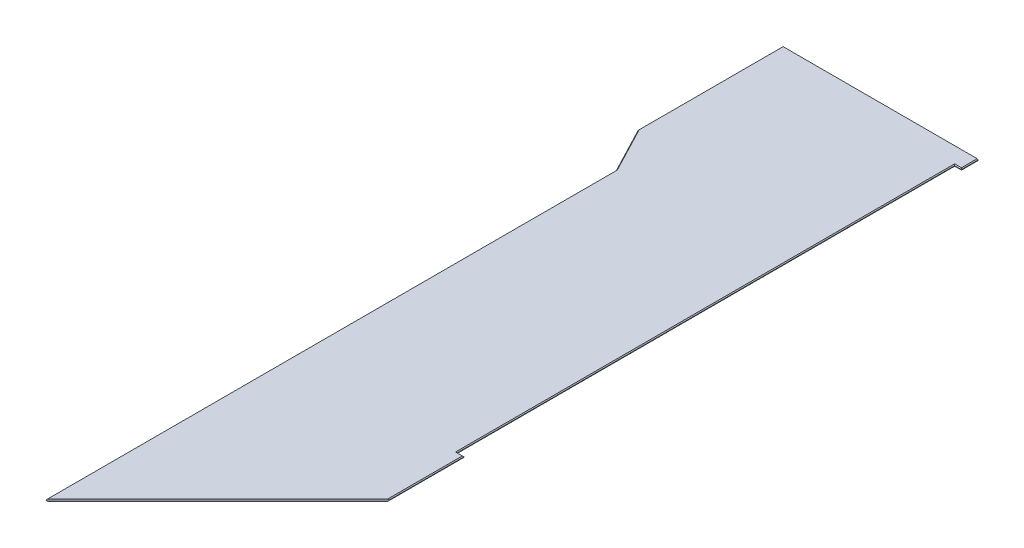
ISO-10303-21;
HEADER;
FILE_DESCRIPTION(('STEP AP214'),'2;1');
FILE_NAME('part.step','',(''),(''),'','','');
FILE_SCHEMA(('AUTOMOTIVE_DESIGN { 1 0 10303 214 1 1 1 1 }'));
ENDSEC;
DATA;
#1=APPLICATION_CONTEXT('core data for automotive mechanical design processes');
#2=APPLICATION_PROTOCOL_DEFINITION('international standard','automotive_design',2000,#1);
#3=PRODUCT_CONTEXT('',#1,'mechanical');
#4=PRODUCT('Part','Part','',(#3));
#5=PRODUCT_RELATED_PRODUCT_CATEGORY('part','',(#4));
#6=PRODUCT_DEFINITION_FORMATION('','',#4);
#7=PRODUCT_DEFINITION_CONTEXT('part definition',#1,'design');
#8=PRODUCT_DEFINITION('design','',#6,#7);
#9=PRODUCT_DEFINITION_SHAPE('','',#8);
#10=(LENGTH_UNIT() NAMED_UNIT(*) SI_UNIT(.MILLI.,.METRE.));
#11=(NAMED_UNIT(*) PLANE_ANGLE_UNIT() SI_UNIT($,.RADIAN.));
#12=(NAMED_UNIT(*) SI_UNIT($,.STERADIAN.) SOLID_ANGLE_UNIT());
#13=UNCERTAINTY_MEASURE_WITH_UNIT(LENGTH_MEASURE(1.E-05),#10,'distance_accuracy_value','');
#14=(GEOMETRIC_REPRESENTATION_CONTEXT(3) GLOBAL_UNCERTAINTY_ASSIGNED_CONTEXT((#13)) GLOBAL_UNIT_ASSIGNED_CONTEXT((#10,
#11,#12)) REPRESENTATION_CONTEXT('',''));
#15=CARTESIAN_POINT('',(0.,0.,0.));
#16=DIRECTION('',(0.,0.,1.));
#17=DIRECTION('',(1.,0.,0.));
#18=AXIS2_PLACEMENT_3D('',#15,#16,#17);
#19=CARTESIAN_POINT('',(552.551731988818,6.35,994.453846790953));
#20=DIRECTION('',(0.,0.,1.));
#21=DIRECTION('',(1.,0.,0.));
#22=AXIS2_PLACEMENT_3D('',#19,#20,#21);
#23=PLANE('',#22);
#24=DIRECTION('',(0.,-1.,0.));
#25=VECTOR('',#24,1.);
#26=CARTESIAN_POINT('',(552.551731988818,6.35,994.453846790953));
#27=LINE('',#26,#25);
#28=CARTESIAN_POINT('',(552.551731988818,1.35000000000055,994.453846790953));
#29=VERTEX_POINT('',#28);
#30=CARTESIAN_POINT('',(552.551731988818,-1.35000000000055,994.453846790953));
#31=VERTEX_POINT('',#30);
#32=EDGE_CURVE('E394',#29,#31,#27,.T.);
#33=ORIENTED_EDGE('',*,*,#32,.T.);
#34=DIRECTION('',(-1.,0.,0.));
#35=VECTOR('',#34,1.);
#36=CARTESIAN_POINT('',(511.451731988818,-1.35000000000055,994.453846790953));
#37=LINE('',#36,#35);
#38=CARTESIAN_POINT('',(511.451731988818,-1.35000000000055,994.453846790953));
#39=VERTEX_POINT('',#38);
#40=EDGE_CURVE('E326',#31,#39,#37,.T.);
#41=ORIENTED_EDGE('',*,*,#40,.T.);
#42=DIRECTION('',(0.,-1.,0.));
#43=VECTOR('',#42,1.);
#44=CARTESIAN_POINT('',(511.451731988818,6.35,994.453846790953));
#45=LINE('',#44,#43);
#46=CARTESIAN_POINT('',(511.451731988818,1.35000000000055,994.453846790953));
#47=VERTEX_POINT('',#46);
#48=EDGE_CURVE('E220',#47,#39,#45,.T.);
#49=ORIENTED_EDGE('',*,*,#48,.F.);
#50=DIRECTION('',(1.,0.,0.));
#51=VECTOR('',#50,1.);
#52=CARTESIAN_POINT('',(552.551731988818,1.35000000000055,994.453846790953));
#53=LINE('',#52,#51);
#54=EDGE_CURVE('E72',#47,#29,#53,.T.);
#55=ORIENTED_EDGE('',*,*,#54,.T.);
#56=EDGE_LOOP('',(#33,#41,#49,#55));
#57=FACE_BOUND('',#56,.T.);
#58=ADVANCED_FACE('F50',(#57),#23,.F.);
#59=CARTESIAN_POINT('',(511.451731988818,6.35,994.453846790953));
#60=DIRECTION('',(-1.,0.,0.));
#61=DIRECTION('',(0.,0.,1.));
#62=AXIS2_PLACEMENT_3D('',#59,#60,#61);
#63=PLANE('',#62);
#64=ORIENTED_EDGE('',*,*,#48,.T.);
#65=DIRECTION('',(0.,0.,-1.));
#66=VECTOR('',#65,1.);
#67=CARTESIAN_POINT('',(511.451731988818,-1.35000000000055,-2017.54615320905));
#68=LINE('',#67,#66);
#69=CARTESIAN_POINT('',(511.451731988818,-1.35000000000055,-2017.54615320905));
#70=VERTEX_POINT('',#69);
#71=EDGE_CURVE('E323',#39,#70,#68,.T.);
#72=ORIENTED_EDGE('',*,*,#71,.T.);
#73=DIRECTION('',(0.,-1.,0.));
#74=VECTOR('',#73,1.);
#75=CARTESIAN_POINT('',(511.451731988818,6.35,-2017.54615320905));
#76=LINE('',#75,#74);
#77=CARTESIAN_POINT('',(511.451731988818,1.35000000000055,-2017.54615320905));
#78=VERTEX_POINT('',#77);
#79=EDGE_CURVE('E228',#78,#70,#76,.T.);
#80=ORIENTED_EDGE('',*,*,#79,.F.);
#81=DIRECTION('',(0.,0.,1.));
#82=VECTOR('',#81,1.);
#83=CARTESIAN_POINT('',(511.451731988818,1.35000000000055,994.453846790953));
#84=LINE('',#83,#82);
#85=EDGE_CURVE('E325',#78,#47,#84,.T.);
#86=ORIENTED_EDGE('',*,*,#85,.T.);
#87=EDGE_LOOP('',(#64,#72,#80,#86));
#88=FACE_BOUND('',#87,.T.);
#89=ADVANCED_FACE('F464',(#88),#63,.F.);
#90=CARTESIAN_POINT('',(511.451731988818,6.35,-2017.54615320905));
#91=DIRECTION('',(0.,0.,-1.));
#92=DIRECTION('',(-1.,0.,0.));
#93=AXIS2_PLACEMENT_3D('',#90,#91,#92);
#94=PLANE('',#93);
#95=ORIENTED_EDGE('',*,*,#79,.T.);
#96=DIRECTION('',(1.,0.,0.));
#97=VECTOR('',#96,1.);
#98=CARTESIAN_POINT('',(552.551731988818,-1.35000000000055,-2017.54615320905));
#99=LINE('',#98,#97);
#100=CARTESIAN_POINT('',(552.551731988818,-1.35000000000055,-2017.54615320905));
#101=VERTEX_POINT('',#100);
#102=EDGE_CURVE('E316',#70,#101,#99,.T.);
#103=ORIENTED_EDGE('',*,*,#102,.T.);
#104=DIRECTION('',(0.,-1.,0.));
#105=VECTOR('',#104,1.);
#106=CARTESIAN_POINT('',(552.551731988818,6.35,-2017.54615320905));
#107=LINE('',#106,#105);
#108=CARTESIAN_POINT('',(552.551731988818,1.35000000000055,-2017.54615320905));
#109=VERTEX_POINT('',#108);
#110=EDGE_CURVE('E411',#109,#101,#107,.T.);
#111=ORIENTED_EDGE('',*,*,#110,.F.);
#112=DIRECTION('',(-1.,0.,0.));
#113=VECTOR('',#112,1.);
#114=CARTESIAN_POINT('',(511.451731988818,1.35000000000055,-2017.54615320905));
#115=LINE('',#114,#113);
#116=EDGE_CURVE('E317',#109,#78,#115,.T.);
#117=ORIENTED_EDGE('',*,*,#116,.T.);
#118=EDGE_LOOP('',(#95,#103,#111,#117));
#119=FACE_BOUND('',#118,.T.);
#120=ADVANCED_FACE('F421',(#119),#94,.F.);
#121=CARTESIAN_POINT('',(552.551731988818,6.35,-2017.54615320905));
#122=DIRECTION('',(-1.,0.,0.));
#123=DIRECTION('',(0.,0.,1.));
#124=AXIS2_PLACEMENT_3D('',#121,#122,#123);
#125=PLANE('',#124);
#126=ORIENTED_EDGE('',*,*,#110,.T.);
#127=DIRECTION('',(0.,0.,-1.));
#128=VECTOR('',#127,1.);
#129=CARTESIAN_POINT('',(552.551731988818,-1.35000000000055,-2117.54615320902));
#130=LINE('',#129,#128);
#131=CARTESIAN_POINT('',(552.551731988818,-1.35000000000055,-2117.54615320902));
#132=VERTEX_POINT('',#131);
#133=EDGE_CURVE('E315',#101,#132,#130,.T.);
#134=ORIENTED_EDGE('',*,*,#133,.T.);
#135=DIRECTION('',(0.,-1.,0.));
#136=VECTOR('',#135,1.);
#137=CARTESIAN_POINT('',(552.551731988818,6.35,-2117.54615320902));
#138=LINE('',#137,#136);
#139=CARTESIAN_POINT('',(552.551731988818,1.35000000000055,-2117.54615320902));
#140=VERTEX_POINT('',#139);
#141=EDGE_CURVE('E413',#140,#132,#138,.T.);
#142=ORIENTED_EDGE('',*,*,#141,.F.);
#143=DIRECTION('',(0.,0.,1.));
#144=VECTOR('',#143,1.);
#145=CARTESIAN_POINT('',(552.551731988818,1.35000000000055,-2017.54615320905));
#146=LINE('',#145,#144);
#147=EDGE_CURVE('E307',#140,#109,#146,.T.);
#148=ORIENTED_EDGE('',*,*,#147,.T.);
#149=EDGE_LOOP('',(#126,#134,#142,#148));
#150=FACE_BOUND('',#149,.T.);
#151=ADVANCED_FACE('F445',(#150),#125,.F.);
#152=CARTESIAN_POINT('',(552.551731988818,6.35,-2117.54615320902));
#153=DIRECTION('',(0.,0.,1.));
#154=DIRECTION('',(1.,0.,0.));
#155=AXIS2_PLACEMENT_3D('',#152,#153,#154);
#156=PLANE('',#155);
#157=DIRECTION('',(-1.,0.,0.));
#158=VECTOR('',#157,1.);
#159=CARTESIAN_POINT('',(552.551731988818,-6.35,-2117.54615320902));
#160=LINE('',#159,#158);
#161=CARTESIAN_POINT('',(547.551731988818,-6.35,-2117.54615320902));
#162=VERTEX_POINT('',#161);
#163=CARTESIAN_POINT('',(-627.248268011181,-6.35,-2117.54615320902));
#164=VERTEX_POINT('',#163);
#165=EDGE_CURVE('E341',#162,#164,#160,.T.);
#166=ORIENTED_EDGE('',*,*,#165,.T.);
#167=DIRECTION('',(-0.707106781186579,0.707106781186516,0.));
#168=VECTOR('',#167,1.);
#169=CARTESIAN_POINT('',(-632.248268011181,-1.35000000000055,-2117.54615320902));
#170=LINE('',#169,#168);
#171=CARTESIAN_POINT('',(-632.248268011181,-1.35000000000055,-2117.54615320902));
#172=VERTEX_POINT('',#171);
#173=EDGE_CURVE('E283',#164,#172,#170,.T.);
#174=ORIENTED_EDGE('',*,*,#173,.T.);
#175=DIRECTION('',(0.,-1.,0.));
#176=VECTOR('',#175,1.);
#177=CARTESIAN_POINT('',(-632.248268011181,6.35,-2117.54615320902));
#178=LINE('',#177,#176);
#179=CARTESIAN_POINT('',(-632.248268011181,1.35000000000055,-2117.54615320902));
#180=VERTEX_POINT('',#179);
#181=EDGE_CURVE('E410',#180,#172,#178,.T.);
#182=ORIENTED_EDGE('',*,*,#181,.F.);
#183=DIRECTION('',(-0.707106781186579,-0.707106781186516,0.));
#184=VECTOR('',#183,1.);
#185=CARTESIAN_POINT('',(-627.248268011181,6.35,-2117.54615320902));
#186=LINE('',#185,#184);
#187=CARTESIAN_POINT('',(-627.248268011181,6.35,-2117.54615320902));
#188=VERTEX_POINT('',#187);
#189=EDGE_CURVE('E279',#180,#188,#186,.F.);
#190=ORIENTED_EDGE('',*,*,#189,.T.);
#191=DIRECTION('',(-1.,0.,0.));
#192=VECTOR('',#191,1.);
#193=CARTESIAN_POINT('',(552.551731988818,6.35,-2117.54615320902));
#194=LINE('',#193,#192);
#195=CARTESIAN_POINT('',(547.551731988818,6.35,-2117.54615320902));
#196=VERTEX_POINT('',#195);
#197=EDGE_CURVE('E448',#196,#188,#194,.T.);
#198=ORIENTED_EDGE('',*,*,#197,.F.);
#199=DIRECTION('',(-0.707106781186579,0.707106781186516,0.));
#200=VECTOR('',#199,1.);
#201=CARTESIAN_POINT('',(547.551731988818,6.35,-2117.54615320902));
#202=LINE('',#201,#200);
#203=EDGE_CURVE('E275',#196,#140,#202,.F.);
#204=ORIENTED_EDGE('',*,*,#203,.T.);
#205=ORIENTED_EDGE('',*,*,#141,.T.);
#206=DIRECTION('',(-0.707106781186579,-0.707106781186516,0.));
#207=VECTOR('',#206,1.);
#208=CARTESIAN_POINT('',(552.551731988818,-1.35000000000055,-2117.54615320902));
#209=LINE('',#208,#207);
#210=EDGE_CURVE('E273',#132,#162,#209,.T.);
#211=ORIENTED_EDGE('',*,*,#210,.T.);
#212=EDGE_LOOP('',(#166,#174,#182,#190,#198,#204,#205,#211));
#213=FACE_BOUND('',#212,.T.);
#214=ADVANCED_FACE('F447',(#213),#156,.F.);
#215=CARTESIAN_POINT('',(-632.248268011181,6.35,-2117.54615320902));
#216=DIRECTION('',(1.,0.,0.));
#217=DIRECTION('',(0.,0.,-1.));
#218=AXIS2_PLACEMENT_3D('',#215,#216,#217);
#219=PLANE('',#218);
#220=ORIENTED_EDGE('',*,*,#181,.T.);
#221=DIRECTION('',(0.,0.,1.));
#222=VECTOR('',#221,1.);
#223=CARTESIAN_POINT('',(-632.248268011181,-1.35000000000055,-1245.01955496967));
#224=LINE('',#223,#222);
#225=CARTESIAN_POINT('',(-632.248268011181,-1.35000000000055,-1245.01955496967));
#226=VERTEX_POINT('',#225);
#227=EDGE_CURVE('E266',#172,#226,#224,.T.);
#228=ORIENTED_EDGE('',*,*,#227,.T.);
#229=DIRECTION('',(0.,-1.,0.));
#230=VECTOR('',#229,1.);
#231=CARTESIAN_POINT('',(-632.248268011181,6.35,-1245.01955496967));
#232=LINE('',#231,#230);
#233=CARTESIAN_POINT('',(-632.248268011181,1.35000000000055,-1245.01955496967));
#234=VERTEX_POINT('',#233);
#235=EDGE_CURVE('E401',#234,#226,#232,.T.);
#236=ORIENTED_EDGE('',*,*,#235,.F.);
#237=DIRECTION('',(0.,0.,-1.));
#238=VECTOR('',#237,1.);
#239=CARTESIAN_POINT('',(-632.248268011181,1.35000000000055,-2117.54615320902));
#240=LINE('',#239,#238);
#241=EDGE_CURVE('E267',#234,#180,#240,.T.);
#242=ORIENTED_EDGE('',*,*,#241,.T.);
#243=EDGE_LOOP('',(#220,#228,#236,#242));
#244=FACE_BOUND('',#243,.T.);
#245=ADVANCED_FACE('F690',(#244),#219,.F.);
#246=CARTESIAN_POINT('',(-487.06076801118,6.35,-967.229254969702));
#247=DIRECTION('',(0.886253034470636,0.,-0.463201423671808));
#248=DIRECTION('',(-0.463201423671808,0.,-0.886253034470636));
#249=AXIS2_PLACEMENT_3D('',#246,#247,#248);
#250=PLANE('',#249);
#251=ORIENTED_EDGE('',*,*,#235,.T.);
#252=DIRECTION('',(0.463201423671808,0.,0.886253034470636));
#253=VECTOR('',#252,1.);
#254=CARTESIAN_POINT('',(-487.06076801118,-1.35000000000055,-967.229254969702));
#255=LINE('',#254,#253);
#256=CARTESIAN_POINT('',(-487.06076801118,-1.35000000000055,-967.229254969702));
#257=VERTEX_POINT('',#256);
#258=EDGE_CURVE('E262',#226,#257,#255,.T.);
#259=ORIENTED_EDGE('',*,*,#258,.T.);
#260=DIRECTION('',(0.,-1.,0.));
#261=VECTOR('',#260,1.);
#262=CARTESIAN_POINT('',(-487.06076801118,6.35,-967.229254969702));
#263=LINE('',#262,#261);
#264=CARTESIAN_POINT('',(-487.06076801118,1.35000000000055,-967.229254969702));
#265=VERTEX_POINT('',#264);
#266=EDGE_CURVE('E212',#265,#257,#263,.T.);
#267=ORIENTED_EDGE('',*,*,#266,.F.);
#268=DIRECTION('',(-0.463201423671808,0.,-0.886253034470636));
#269=VECTOR('',#268,1.);
#270=CARTESIAN_POINT('',(-487.06076801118,1.35000000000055,-967.229254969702));
#271=LINE('',#270,#269);
#272=EDGE_CURVE('E258',#265,#234,#271,.T.);
#273=ORIENTED_EDGE('',*,*,#272,.T.);
#274=EDGE_LOOP('',(#251,#259,#267,#273));
#275=FACE_BOUND('',#274,.T.);
#276=ADVANCED_FACE('F676',(#275),#250,.F.);
#277=CARTESIAN_POINT('',(-487.06076801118,6.35,2485.26634679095));
#278=DIRECTION('',(1.,0.,0.));
#279=DIRECTION('',(0.,0.,-1.));
#280=AXIS2_PLACEMENT_3D('',#277,#278,#279);
#281=PLANE('',#280);
#282=ORIENTED_EDGE('',*,*,#266,.T.);
#283=DIRECTION('',(0.,0.,1.));
#284=VECTOR('',#283,1.);
#285=CARTESIAN_POINT('',(-487.06076801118,-1.35000000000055,2485.26634679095));
#286=LINE('',#285,#284);
#287=CARTESIAN_POINT('',(-487.06076801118,-1.35000000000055,2485.26634679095));
#288=VERTEX_POINT('',#287);
#289=EDGE_CURVE('E209',#257,#288,#286,.T.);
#290=ORIENTED_EDGE('',*,*,#289,.T.);
#291=DIRECTION('',(0.,-1.,0.));
#292=VECTOR('',#291,1.);
#293=CARTESIAN_POINT('',(-487.06076801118,6.35,2485.26634679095));
#294=LINE('',#293,#292);
#295=CARTESIAN_POINT('',(-487.06076801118,1.35000000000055,2485.26634679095));
#296=VERTEX_POINT('',#295);
#297=EDGE_CURVE('E192',#296,#288,#294,.T.);
#298=ORIENTED_EDGE('',*,*,#297,.F.);
#299=DIRECTION('',(0.,0.,-1.));
#300=VECTOR('',#299,1.);
#301=CARTESIAN_POINT('',(-487.06076801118,1.35000000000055,2485.26634679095));
#302=LINE('',#301,#300);
#303=EDGE_CURVE('E207',#296,#265,#302,.T.);
#304=ORIENTED_EDGE('',*,*,#303,.T.);
#305=EDGE_LOOP('',(#282,#290,#298,#304));
#306=FACE_BOUND('',#305,.T.);
#307=ADVANCED_FACE('F203',(#306),#281,.F.);
#308=CARTESIAN_POINT('',(552.551731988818,6.35,1445.65384679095));
#309=DIRECTION('',(-0.707106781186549,0.,-0.707106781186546));
#310=DIRECTION('',(-0.707106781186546,0.,0.707106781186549));
#311=AXIS2_PLACEMENT_3D('',#308,#309,#310);
#312=PLANE('',#311);
#313=ORIENTED_EDGE('',*,*,#297,.T.);
#314=DIRECTION('',(0.577350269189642,-0.577350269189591,-0.577350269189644));
#315=VECTOR('',#314,1.);
#316=CARTESIAN_POINT('',(-487.06076801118,-1.35000000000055,2485.26634679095));
#317=LINE('',#316,#315);
#318=CARTESIAN_POINT('',(-482.06076801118,-6.35,2480.26634679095));
#319=VERTEX_POINT('',#318);
#320=EDGE_CURVE('E200',#288,#319,#317,.T.);
#321=ORIENTED_EDGE('',*,*,#320,.T.);
#322=DIRECTION('',(0.707106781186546,0.,-0.707106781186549));
#323=VECTOR('',#322,1.);
#324=CARTESIAN_POINT('',(552.551731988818,-6.35,1445.65384679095));
#325=LINE('',#324,#323);
#326=CARTESIAN_POINT('',(547.551731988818,-6.35,1450.65384679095));
#327=VERTEX_POINT('',#326);
#328=EDGE_CURVE('E765',#319,#327,#325,.T.);
#329=ORIENTED_EDGE('',*,*,#328,.T.);
#330=DIRECTION('',(0.577350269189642,0.577350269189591,-0.577350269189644));
#331=VECTOR('',#330,1.);
#332=CARTESIAN_POINT('',(552.551731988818,-1.35000000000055,1445.65384679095));
#333=LINE('',#332,#331);
#334=CARTESIAN_POINT('',(552.551731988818,-1.35000000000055,1445.65384679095));
#335=VERTEX_POINT('',#334);
#336=EDGE_CURVE('E196',#327,#335,#333,.T.);
#337=ORIENTED_EDGE('',*,*,#336,.T.);
#338=DIRECTION('',(0.,-1.,0.));
#339=VECTOR('',#338,1.);
#340=CARTESIAN_POINT('',(552.551731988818,6.35,1445.65384679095));
#341=LINE('',#340,#339);
#342=CARTESIAN_POINT('',(552.551731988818,1.35000000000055,1445.65384679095));
#343=VERTEX_POINT('',#342);
#344=EDGE_CURVE('E215',#343,#335,#341,.T.);
#345=ORIENTED_EDGE('',*,*,#344,.F.);
#346=DIRECTION('',(0.577350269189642,-0.577350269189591,-0.577350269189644));
#347=VECTOR('',#346,1.);
#348=CARTESIAN_POINT('',(1031.1030142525,-477.201282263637,967.102564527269));
#349=LINE('',#348,#347);
#350=CARTESIAN_POINT('',(547.551731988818,6.35,1450.65384679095));
#351=VERTEX_POINT('',#350);
#352=EDGE_CURVE('E224',#343,#351,#349,.F.);
#353=ORIENTED_EDGE('',*,*,#352,.T.);
#354=DIRECTION('',(0.707106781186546,0.,-0.707106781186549));
#355=VECTOR('',#354,1.);
#356=CARTESIAN_POINT('',(552.551731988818,6.35,1445.65384679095));
#357=LINE('',#356,#355);
#358=CARTESIAN_POINT('',(-482.06076801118,6.35,2480.26634679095));
#359=VERTEX_POINT('',#358);
#360=EDGE_CURVE('E194',#359,#351,#357,.T.);
#361=ORIENTED_EDGE('',*,*,#360,.F.);
#362=DIRECTION('',(0.577350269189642,0.577350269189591,-0.577350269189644));
#363=VECTOR('',#362,1.);
#364=CARTESIAN_POINT('',(344.694680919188,833.105448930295,1653.51089786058));
#365=LINE('',#364,#363);
#366=EDGE_CURVE('E189',#359,#296,#365,.F.);
#367=ORIENTED_EDGE('',*,*,#366,.T.);
#368=EDGE_LOOP('',(#313,#321,#329,#337,#345,#353,#361,#367));
#369=FACE_BOUND('',#368,.T.);
#370=ADVANCED_FACE('F188',(#369),#312,.F.);
#371=CARTESIAN_POINT('',(552.551731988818,6.35,1445.65384679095));
#372=DIRECTION('',(-1.,0.,0.));
#373=DIRECTION('',(0.,0.,1.));
#374=AXIS2_PLACEMENT_3D('',#371,#372,#373);
#375=PLANE('',#374);
#376=ORIENTED_EDGE('',*,*,#344,.T.);
#377=DIRECTION('',(0.,0.,-1.));
#378=VECTOR('',#377,1.);
#379=CARTESIAN_POINT('',(552.551731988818,-1.35000000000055,994.453846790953));
#380=LINE('',#379,#378);
#381=EDGE_CURVE('E11',#335,#31,#380,.T.);
#382=ORIENTED_EDGE('',*,*,#381,.T.);
#383=ORIENTED_EDGE('',*,*,#32,.F.);
#384=DIRECTION('',(0.,0.,1.));
#385=VECTOR('',#384,1.);
#386=CARTESIAN_POINT('',(552.551731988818,1.35000000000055,1445.65384679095));
#387=LINE('',#386,#385);
#388=EDGE_CURVE('E59',#29,#343,#387,.T.);
#389=ORIENTED_EDGE('',*,*,#388,.T.);
#390=EDGE_LOOP('',(#376,#382,#383,#389));
#391=FACE_BOUND('',#390,.T.);
#392=ADVANCED_FACE('F393',(#391),#375,.F.);
#393=CARTESIAN_POINT('',(0.,6.35,0.));
#394=DIRECTION('',(0.,-1.,0.));
#395=DIRECTION('',(0.,0.,-1.));
#396=AXIS2_PLACEMENT_3D('',#393,#394,#395);
#397=PLANE('',#396);
#398=DIRECTION('',(0.463201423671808,0.,0.886253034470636));
#399=VECTOR('',#398,1.);
#400=CARTESIAN_POINT('',(18.9329210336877,6.35,-9.89531842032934));
#401=LINE('',#400,#399);
#402=CARTESIAN_POINT('',(-627.248268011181,6.35,-1246.24738977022));
#403=VERTEX_POINT('',#402);
#404=CARTESIAN_POINT('',(-482.060768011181,6.35,-968.457089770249));
#405=VERTEX_POINT('',#404);
#406=EDGE_CURVE('E303',#403,#405,#401,.T.);
#407=ORIENTED_EDGE('',*,*,#406,.T.);
#408=DIRECTION('',(0.,0.,1.));
#409=VECTOR('',#408,1.);
#410=CARTESIAN_POINT('',(-482.060768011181,6.35,0.));
#411=LINE('',#410,#409);
#412=EDGE_CURVE('E306',#405,#359,#411,.T.);
#413=ORIENTED_EDGE('',*,*,#412,.T.);
#414=ORIENTED_EDGE('',*,*,#360,.T.);
#415=DIRECTION('',(0.,0.,-1.));
#416=VECTOR('',#415,1.);
#417=CARTESIAN_POINT('',(547.551731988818,6.35,0.));
#418=LINE('',#417,#416);
#419=CARTESIAN_POINT('',(547.551731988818,6.35,999.453846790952));
#420=VERTEX_POINT('',#419);
#421=EDGE_CURVE('E285',#351,#420,#418,.T.);
#422=ORIENTED_EDGE('',*,*,#421,.T.);
#423=DIRECTION('',(-1.,0.,0.));
#424=VECTOR('',#423,1.);
#425=CARTESIAN_POINT('',(0.,6.35,999.453846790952));
#426=LINE('',#425,#424);
#427=CARTESIAN_POINT('',(506.451731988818,6.35,999.453846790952));
#428=VERTEX_POINT('',#427);
#429=EDGE_CURVE('E290',#420,#428,#426,.T.);
#430=ORIENTED_EDGE('',*,*,#429,.T.);
#431=DIRECTION('',(0.,0.,-1.));
#432=VECTOR('',#431,1.);
#433=CARTESIAN_POINT('',(506.451731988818,6.35,0.));
#434=LINE('',#433,#432);
#435=CARTESIAN_POINT('',(506.451731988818,6.35,-2022.54615320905));
#436=VERTEX_POINT('',#435);
#437=EDGE_CURVE('E288',#428,#436,#434,.T.);
#438=ORIENTED_EDGE('',*,*,#437,.T.);
#439=DIRECTION('',(1.,0.,0.));
#440=VECTOR('',#439,1.);
#441=CARTESIAN_POINT('',(0.,6.35,-2022.54615320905));
#442=LINE('',#441,#440);
#443=CARTESIAN_POINT('',(547.551731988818,6.35,-2022.54615320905));
#444=VERTEX_POINT('',#443);
#445=EDGE_CURVE('E291',#436,#444,#442,.T.);
#446=ORIENTED_EDGE('',*,*,#445,.T.);
#447=DIRECTION('',(0.,0.,-1.));
#448=VECTOR('',#447,1.);
#449=CARTESIAN_POINT('',(547.551731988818,6.35,0.));
#450=LINE('',#449,#448);
#451=EDGE_CURVE('E298',#444,#196,#450,.T.);
#452=ORIENTED_EDGE('',*,*,#451,.T.);
#453=ORIENTED_EDGE('',*,*,#197,.T.);
#454=DIRECTION('',(0.,0.,1.));
#455=VECTOR('',#454,1.);
#456=CARTESIAN_POINT('',(-627.248268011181,6.35,0.));
#457=LINE('',#456,#455);
#458=EDGE_CURVE('E297',#188,#403,#457,.T.);
#459=ORIENTED_EDGE('',*,*,#458,.T.);
#460=EDGE_LOOP('',(#407,#413,#414,#422,#430,#438,#446,#452,#453,#459));
#461=FACE_BOUND('',#460,.T.);
#462=ADVANCED_FACE('F453',(#461),#397,.F.);
#463=CARTESIAN_POINT('',(0.,-6.35,0.));
#464=DIRECTION('',(0.,-1.,0.));
#465=DIRECTION('',(0.,0.,-1.));
#466=AXIS2_PLACEMENT_3D('',#463,#464,#465);
#467=PLANE('',#466);
#468=ORIENTED_EDGE('',*,*,#328,.F.);
#469=DIRECTION('',(0.,0.,-1.));
#470=VECTOR('',#469,1.);
#471=CARTESIAN_POINT('',(-482.060768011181,-6.35,-967.229254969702));
#472=LINE('',#471,#470);
#473=CARTESIAN_POINT('',(-482.060768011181,-6.35,-968.457089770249));
#474=VERTEX_POINT('',#473);
#475=EDGE_CURVE('E260',#319,#474,#472,.T.);
#476=ORIENTED_EDGE('',*,*,#475,.T.);
#477=DIRECTION('',(-0.463201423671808,0.,-0.886253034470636));
#478=VECTOR('',#477,1.);
#479=CARTESIAN_POINT('',(-627.817002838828,-6.35,-1247.33556208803));
#480=LINE('',#479,#478);
#481=CARTESIAN_POINT('',(-627.248268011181,-6.35,-1246.24738977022));
#482=VERTEX_POINT('',#481);
#483=EDGE_CURVE('E251',#474,#482,#480,.T.);
#484=ORIENTED_EDGE('',*,*,#483,.T.);
#485=DIRECTION('',(0.,0.,-1.));
#486=VECTOR('',#485,1.);
#487=CARTESIAN_POINT('',(-627.248268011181,-6.35,-2117.54615320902));
#488=LINE('',#487,#486);
#489=EDGE_CURVE('E252',#482,#164,#488,.T.);
#490=ORIENTED_EDGE('',*,*,#489,.T.);
#491=ORIENTED_EDGE('',*,*,#165,.F.);
#492=DIRECTION('',(0.,0.,1.));
#493=VECTOR('',#492,1.);
#494=CARTESIAN_POINT('',(547.551731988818,-6.35,-2017.54615320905));
#495=LINE('',#494,#493);
#496=CARTESIAN_POINT('',(547.551731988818,-6.35,-2022.54615320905));
#497=VERTEX_POINT('',#496);
#498=EDGE_CURVE('E247',#162,#497,#495,.T.);
#499=ORIENTED_EDGE('',*,*,#498,.T.);
#500=DIRECTION('',(-1.,0.,0.));
#501=VECTOR('',#500,1.);
#502=CARTESIAN_POINT('',(511.451731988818,-6.35,-2022.54615320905));
#503=LINE('',#502,#501);
#504=CARTESIAN_POINT('',(506.451731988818,-6.35,-2022.54615320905));
#505=VERTEX_POINT('',#504);
#506=EDGE_CURVE('E244',#497,#505,#503,.T.);
#507=ORIENTED_EDGE('',*,*,#506,.T.);
#508=DIRECTION('',(0.,0.,1.));
#509=VECTOR('',#508,1.);
#510=CARTESIAN_POINT('',(506.451731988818,-6.35,994.453846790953));
#511=LINE('',#510,#509);
#512=CARTESIAN_POINT('',(506.451731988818,-6.35,999.453846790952));
#513=VERTEX_POINT('',#512);
#514=EDGE_CURVE('E245',#505,#513,#511,.T.);
#515=ORIENTED_EDGE('',*,*,#514,.T.);
#516=DIRECTION('',(1.,0.,0.));
#517=VECTOR('',#516,1.);
#518=CARTESIAN_POINT('',(552.551731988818,-6.35,999.453846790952));
#519=LINE('',#518,#517);
#520=CARTESIAN_POINT('',(547.551731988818,-6.35,999.453846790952));
#521=VERTEX_POINT('',#520);
#522=EDGE_CURVE('E237',#513,#521,#519,.T.);
#523=ORIENTED_EDGE('',*,*,#522,.T.);
#524=DIRECTION('',(0.,0.,1.));
#525=VECTOR('',#524,1.);
#526=CARTESIAN_POINT('',(547.551731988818,-6.35,1445.65384679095));
#527=LINE('',#526,#525);
#528=EDGE_CURVE('E236',#521,#327,#527,.T.);
#529=ORIENTED_EDGE('',*,*,#528,.T.);
#530=EDGE_LOOP('',(#468,#476,#484,#490,#491,#499,#507,#515,#523,#529));
#531=FACE_BOUND('',#530,.T.);
#532=ADVANCED_FACE('F474',(#531),#467,.T.);
#533=CARTESIAN_POINT('',(-632.248268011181,-1.35000000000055,-2117.54615320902));
#534=DIRECTION('',(-0.707106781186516,-0.707106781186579,0.));
#535=DIRECTION('',(0.,0.,-1.));
#536=AXIS2_PLACEMENT_3D('',#533,#534,#535);
#537=PLANE('',#536);
#538=ORIENTED_EDGE('',*,*,#173,.F.);
#539=ORIENTED_EDGE('',*,*,#489,.F.);
#540=DIRECTION('',(-0.696681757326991,0.696681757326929,0.171082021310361));
#541=VECTOR('',#540,1.);
#542=CARTESIAN_POINT('',(-528.252064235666,-105.346203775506,-1270.55758659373));
#543=LINE('',#542,#541);
#544=EDGE_CURVE('E339',#226,#482,#543,.F.);
#545=ORIENTED_EDGE('',*,*,#544,.F.);
#546=ORIENTED_EDGE('',*,*,#227,.F.);
#547=EDGE_LOOP('',(#538,#539,#545,#546));
#548=FACE_BOUND('',#547,.T.);
#549=ADVANCED_FACE('F512',(#548),#537,.T.);
#550=CARTESIAN_POINT('',(-487.06076801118,-1.35000000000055,-967.229254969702));
#551=DIRECTION('',(-0.626675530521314,-0.707106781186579,0.327532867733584));
#552=DIRECTION('',(-0.463201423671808,0.,-0.886253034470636));
#553=AXIS2_PLACEMENT_3D('',#550,#551,#552);
#554=PLANE('',#553);
#555=ORIENTED_EDGE('',*,*,#544,.T.);
#556=ORIENTED_EDGE('',*,*,#483,.F.);
#557=DIRECTION('',(-0.696681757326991,0.696681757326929,0.171082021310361));
#558=VECTOR('',#557,1.);
#559=CARTESIAN_POINT('',(-898.562763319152,410.151995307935,-866.177960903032));
#560=LINE('',#559,#558);
#561=EDGE_CURVE('E333',#257,#474,#560,.F.);
#562=ORIENTED_EDGE('',*,*,#561,.F.);
#563=ORIENTED_EDGE('',*,*,#258,.F.);
#564=EDGE_LOOP('',(#555,#556,#562,#563));
#565=FACE_BOUND('',#564,.T.);
#566=ADVANCED_FACE('F502',(#565),#554,.T.);
#567=CARTESIAN_POINT('',(-487.06076801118,-1.35000000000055,2485.26634679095));
#568=DIRECTION('',(-0.707106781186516,-0.707106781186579,0.));
#569=DIRECTION('',(0.,0.,-1.));
#570=AXIS2_PLACEMENT_3D('',#567,#568,#569);
#571=PLANE('',#570);
#572=ORIENTED_EDGE('',*,*,#561,.T.);
#573=ORIENTED_EDGE('',*,*,#475,.F.);
#574=ORIENTED_EDGE('',*,*,#320,.F.);
#575=ORIENTED_EDGE('',*,*,#289,.F.);
#576=EDGE_LOOP('',(#572,#573,#574,#575));
#577=FACE_BOUND('',#576,.T.);
#578=ADVANCED_FACE('F496',(#577),#571,.T.);
#579=CARTESIAN_POINT('',(-627.248268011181,6.35,0.));
#580=DIRECTION('',(0.707106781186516,-0.707106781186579,0.));
#581=DIRECTION('',(0.,0.,1.));
#582=AXIS2_PLACEMENT_3D('',#579,#580,#581);
#583=PLANE('',#582);
#584=ORIENTED_EDGE('',*,*,#189,.F.);
#585=ORIENTED_EDGE('',*,*,#241,.F.);
#586=DIRECTION('',(0.696681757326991,0.696681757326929,-0.171082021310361));
#587=VECTOR('',#586,1.);
#588=CARTESIAN_POINT('',(-775.78814950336,-142.189881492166,-1209.7709026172));
#589=LINE('',#588,#587);
#590=EDGE_CURVE('E338',#403,#234,#589,.F.);
#591=ORIENTED_EDGE('',*,*,#590,.F.);
#592=ORIENTED_EDGE('',*,*,#458,.F.);
#593=EDGE_LOOP('',(#584,#585,#591,#592));
#594=FACE_BOUND('',#593,.T.);
#595=ADVANCED_FACE('F503',(#594),#583,.F.);
#596=CARTESIAN_POINT('',(18.9329210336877,6.35,-9.89531842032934));
#597=DIRECTION('',(0.626675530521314,-0.707106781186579,-0.327532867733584));
#598=DIRECTION('',(0.463201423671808,0.,0.886253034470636));
#599=AXIS2_PLACEMENT_3D('',#596,#597,#598);
#600=PLANE('',#599);
#601=ORIENTED_EDGE('',*,*,#590,.T.);
#602=ORIENTED_EDGE('',*,*,#272,.F.);
#603=DIRECTION('',(0.696681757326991,0.696681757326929,-0.171082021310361));
#604=VECTOR('',#603,1.);
#605=CARTESIAN_POINT('',(-597.490900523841,-109.08013251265,-940.111263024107));
#606=LINE('',#605,#604);
#607=EDGE_CURVE('E219',#405,#265,#606,.F.);
#608=ORIENTED_EDGE('',*,*,#607,.F.);
#609=ORIENTED_EDGE('',*,*,#406,.F.);
#610=EDGE_LOOP('',(#601,#602,#608,#609));
#611=FACE_BOUND('',#610,.T.);
#612=ADVANCED_FACE('F484',(#611),#600,.F.);
#613=CARTESIAN_POINT('',(-482.060768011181,6.35,0.));
#614=DIRECTION('',(0.707106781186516,-0.707106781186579,0.));
#615=DIRECTION('',(0.,0.,1.));
#616=AXIS2_PLACEMENT_3D('',#613,#614,#615);
#617=PLANE('',#616);
#618=ORIENTED_EDGE('',*,*,#607,.T.);
#619=ORIENTED_EDGE('',*,*,#303,.F.);
#620=ORIENTED_EDGE('',*,*,#366,.F.);
#621=ORIENTED_EDGE('',*,*,#412,.F.);
#622=EDGE_LOOP('',(#618,#619,#620,#621));
#623=FACE_BOUND('',#622,.T.);
#624=ADVANCED_FACE('F213',(#623),#617,.F.);
#625=CARTESIAN_POINT('',(552.551731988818,-1.35000000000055,1445.65384679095));
#626=DIRECTION('',(0.707106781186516,-0.707106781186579,0.));
#627=DIRECTION('',(0.,0.,1.));
#628=AXIS2_PLACEMENT_3D('',#625,#626,#627);
#629=PLANE('',#628);
#630=ORIENTED_EDGE('',*,*,#336,.F.);
#631=ORIENTED_EDGE('',*,*,#528,.F.);
#632=DIRECTION('',(0.577350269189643,0.577350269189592,-0.577350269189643));
#633=VECTOR('',#632,1.);
#634=CARTESIAN_POINT('',(402.15173198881,-151.749999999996,1144.85384679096));
#635=LINE('',#634,#633);
#636=EDGE_CURVE('E349',#31,#521,#635,.F.);
#637=ORIENTED_EDGE('',*,*,#636,.F.);
#638=ORIENTED_EDGE('',*,*,#381,.F.);
#639=EDGE_LOOP('',(#630,#631,#637,#638));
#640=FACE_BOUND('',#639,.T.);
#641=ADVANCED_FACE('F473',(#640),#629,.T.);
#642=CARTESIAN_POINT('',(552.551731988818,-1.35000000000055,994.453846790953));
#643=DIRECTION('',(0.,-0.707106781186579,-0.707106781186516));
#644=DIRECTION('',(1.,0.,0.));
#645=AXIS2_PLACEMENT_3D('',#642,#643,#644);
#646=PLANE('',#645);
#647=ORIENTED_EDGE('',*,*,#636,.T.);
#648=ORIENTED_EDGE('',*,*,#522,.F.);
#649=DIRECTION('',(0.57735026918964,0.577350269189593,-0.577350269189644));
#650=VECTOR('',#649,1.);
#651=CARTESIAN_POINT('',(511.451731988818,-1.35000000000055,994.453846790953));
#652=LINE('',#651,#650);
#653=EDGE_CURVE('E360',#39,#513,#652,.F.);
#654=ORIENTED_EDGE('',*,*,#653,.F.);
#655=ORIENTED_EDGE('',*,*,#40,.F.);
#656=EDGE_LOOP('',(#647,#648,#654,#655));
#657=FACE_BOUND('',#656,.T.);
#658=ADVANCED_FACE('F466',(#657),#646,.T.);
#659=CARTESIAN_POINT('',(511.451731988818,-1.35000000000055,994.453846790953));
#660=DIRECTION('',(0.707106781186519,-0.707106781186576,0.));
#661=DIRECTION('',(0.,0.,1.));
#662=AXIS2_PLACEMENT_3D('',#659,#660,#661);
#663=PLANE('',#662);
#664=ORIENTED_EDGE('',*,*,#653,.T.);
#665=ORIENTED_EDGE('',*,*,#514,.F.);
#666=DIRECTION('',(0.57735026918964,0.577350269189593,0.577350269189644));
#667=VECTOR('',#666,1.);
#668=CARTESIAN_POINT('',(511.451731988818,-1.35000000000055,-2017.54615320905));
#669=LINE('',#668,#667);
#670=EDGE_CURVE('E353',#70,#505,#669,.F.);
#671=ORIENTED_EDGE('',*,*,#670,.F.);
#672=ORIENTED_EDGE('',*,*,#71,.F.);
#673=EDGE_LOOP('',(#664,#665,#671,#672));
#674=FACE_BOUND('',#673,.T.);
#675=ADVANCED_FACE('F431',(#674),#663,.T.);
#676=CARTESIAN_POINT('',(511.451731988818,-1.35000000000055,-2017.54615320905));
#677=DIRECTION('',(0.,-0.707106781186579,0.707106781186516));
#678=DIRECTION('',(-1.,0.,0.));
#679=AXIS2_PLACEMENT_3D('',#676,#677,#678);
#680=PLANE('',#679);
#681=ORIENTED_EDGE('',*,*,#670,.T.);
#682=ORIENTED_EDGE('',*,*,#506,.F.);
#683=DIRECTION('',(0.577350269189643,0.577350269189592,0.577350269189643));
#684=VECTOR('',#683,1.);
#685=CARTESIAN_POINT('',(538.851731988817,-15.0500000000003,-2031.24615320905));
#686=LINE('',#685,#684);
#687=EDGE_CURVE('E352',#101,#497,#686,.F.);
#688=ORIENTED_EDGE('',*,*,#687,.F.);
#689=ORIENTED_EDGE('',*,*,#102,.F.);
#690=EDGE_LOOP('',(#681,#682,#688,#689));
#691=FACE_BOUND('',#690,.T.);
#692=ADVANCED_FACE('F434',(#691),#680,.T.);
#693=CARTESIAN_POINT('',(552.551731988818,-1.35000000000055,-2017.54615320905));
#694=DIRECTION('',(0.707106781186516,-0.707106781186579,0.));
#695=DIRECTION('',(0.,0.,1.));
#696=AXIS2_PLACEMENT_3D('',#693,#694,#695);
#697=PLANE('',#696);
#698=ORIENTED_EDGE('',*,*,#687,.T.);
#699=ORIENTED_EDGE('',*,*,#498,.F.);
#700=ORIENTED_EDGE('',*,*,#210,.F.);
#701=ORIENTED_EDGE('',*,*,#133,.F.);
#702=EDGE_LOOP('',(#698,#699,#700,#701));
#703=FACE_BOUND('',#702,.T.);
#704=ADVANCED_FACE('F437',(#703),#697,.T.);
#705=CARTESIAN_POINT('',(547.551731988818,6.35,0.));
#706=DIRECTION('',(-0.707106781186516,-0.707106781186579,0.));
#707=DIRECTION('',(0.,0.,-1.));
#708=AXIS2_PLACEMENT_3D('',#705,#706,#707);
#709=PLANE('',#708);
#710=ORIENTED_EDGE('',*,*,#352,.F.);
#711=ORIENTED_EDGE('',*,*,#388,.F.);
#712=DIRECTION('',(-0.577350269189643,0.577350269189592,0.577350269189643));
#713=VECTOR('',#712,1.);
#714=CARTESIAN_POINT('',(880.703014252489,-326.801282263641,666.302564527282));
#715=LINE('',#714,#713);
#716=EDGE_CURVE('E55',#420,#29,#715,.F.);
#717=ORIENTED_EDGE('',*,*,#716,.F.);
#718=ORIENTED_EDGE('',*,*,#421,.F.);
#719=EDGE_LOOP('',(#710,#711,#717,#718));
#720=FACE_BOUND('',#719,.T.);
#721=ADVANCED_FACE('F49',(#720),#709,.F.);
#722=CARTESIAN_POINT('',(0.,6.35,999.453846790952));
#723=DIRECTION('',(0.,-0.707106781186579,0.707106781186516));
#724=DIRECTION('',(-1.,0.,0.));
#725=AXIS2_PLACEMENT_3D('',#722,#723,#724);
#726=PLANE('',#725);
#727=ORIENTED_EDGE('',*,*,#716,.T.);
#728=ORIENTED_EDGE('',*,*,#54,.F.);
#729=DIRECTION('',(-0.57735026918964,0.577350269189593,0.577350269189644));
#730=VECTOR('',#729,1.);
#731=CARTESIAN_POINT('',(839.603014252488,-326.801282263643,666.30256452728));
#732=LINE('',#731,#730);
#733=EDGE_CURVE('E373',#428,#47,#732,.F.);
#734=ORIENTED_EDGE('',*,*,#733,.F.);
#735=ORIENTED_EDGE('',*,*,#429,.F.);
#736=EDGE_LOOP('',(#727,#728,#734,#735));
#737=FACE_BOUND('',#736,.T.);
#738=ADVANCED_FACE('F383',(#737),#726,.F.);
#739=CARTESIAN_POINT('',(506.451731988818,6.35,0.));
#740=DIRECTION('',(-0.707106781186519,-0.707106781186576,0.));
#741=DIRECTION('',(0.,0.,-1.));
#742=AXIS2_PLACEMENT_3D('',#739,#740,#741);
#743=PLANE('',#742);
#744=ORIENTED_EDGE('',*,*,#733,.T.);
#745=ORIENTED_EDGE('',*,*,#85,.F.);
#746=DIRECTION('',(-0.57735026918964,0.577350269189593,-0.577350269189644));
#747=VECTOR('',#746,1.);
#748=CARTESIAN_POINT('',(337.634487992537,175.167243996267,-2191.36339720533));
#749=LINE('',#748,#747);
#750=EDGE_CURVE('E369',#436,#78,#749,.F.);
#751=ORIENTED_EDGE('',*,*,#750,.F.);
#752=ORIENTED_EDGE('',*,*,#437,.F.);
#753=EDGE_LOOP('',(#744,#745,#751,#752));
#754=FACE_BOUND('',#753,.T.);
#755=ADVANCED_FACE('F465',(#754),#743,.F.);
#756=CARTESIAN_POINT('',(0.,6.35,-2022.54615320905));
#757=DIRECTION('',(0.,-0.707106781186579,-0.707106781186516));
#758=DIRECTION('',(1.,0.,0.));
#759=AXIS2_PLACEMENT_3D('',#756,#757,#758);
#760=PLANE('',#759);
#761=ORIENTED_EDGE('',*,*,#750,.T.);
#762=ORIENTED_EDGE('',*,*,#116,.F.);
#763=DIRECTION('',(-0.577350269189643,0.577350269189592,-0.577350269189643));
#764=VECTOR('',#763,1.);
#765=CARTESIAN_POINT('',(365.034487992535,188.867243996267,-2205.06339720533));
#766=LINE('',#765,#764);
#767=EDGE_CURVE('E366',#444,#109,#766,.F.);
#768=ORIENTED_EDGE('',*,*,#767,.F.);
#769=ORIENTED_EDGE('',*,*,#445,.F.);
#770=EDGE_LOOP('',(#761,#762,#768,#769));
#771=FACE_BOUND('',#770,.T.);
#772=ADVANCED_FACE('F462',(#771),#760,.F.);
#773=CARTESIAN_POINT('',(547.551731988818,6.35,0.));
#774=DIRECTION('',(-0.707106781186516,-0.707106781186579,0.));
#775=DIRECTION('',(0.,0.,-1.));
#776=AXIS2_PLACEMENT_3D('',#773,#774,#775);
#777=PLANE('',#776);
#778=ORIENTED_EDGE('',*,*,#767,.T.);
#779=ORIENTED_EDGE('',*,*,#147,.F.);
#780=ORIENTED_EDGE('',*,*,#203,.F.);
#781=ORIENTED_EDGE('',*,*,#451,.F.);
#782=EDGE_LOOP('',(#778,#779,#780,#781));
#783=FACE_BOUND('',#782,.T.);
#784=ADVANCED_FACE('F454',(#783),#777,.F.);
#785=CLOSED_SHELL('',(#58,#89,#120,#151,#214,#245,#276,#307,#370,#392,#462,#532,#549,#566,#578,
#595,#612,#624,#641,#658,#675,#692,#704,#721,#738,#755,#772,#784));
#786=MANIFOLD_SOLID_BREP('B2',#785);
#787=ADVANCED_BREP_SHAPE_REPRESENTATION('',(#18,#786),#14);
#788=SHAPE_DEFINITION_REPRESENTATION(#9,#787);
ENDSEC;
END-ISO-10303-21;
